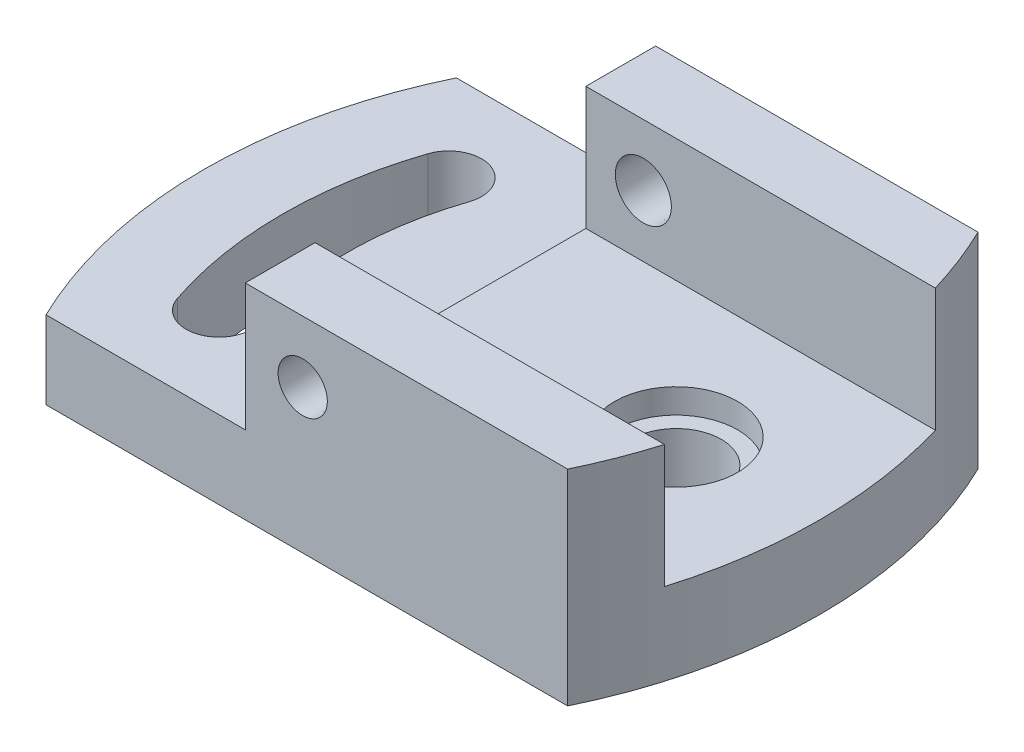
from build123d import *

# Parameters (mm, degrees)
EXTRUDE1_DEPTH     = 19
EXTRUDE2_DEPTH     = 31
CUT_EXTRUDE1_START = -30
CUT_EXTRUDE1_DEPTH = 30
SKETCH5_R          = 7
SKETCH7_R          = 6
CUT_EXTRUDE2_DEPTH = 96.320512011


with BuildPart() as part:
    # Sketch1 → Extrude1 (new body)
    with BuildSketch(Plane(origin=(0, 0, 0), x_dir=(1, 0, 0), z_dir=(0, 1, 0))):
        with BuildLine():
            Line((-63.561575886, 50), (63.561575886, 50))
            ThreePointArc((63.561575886, 50), (75, 0), (63.561575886, -50))
            Line((63.561575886, -50), (-63.561575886, -50))
            ThreePointArc((-63.561575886, -50), (-75, 0), (-63.561575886, 50))
        make_face()
    extrude(amount=EXTRUDE1_DEPTH)

    # Sketch2 → Extrude2 (add)
    with BuildSketch(Plane(origin=(0, 19, 0), x_dir=(-1, 0, 0), z_dir=(0, 1, 0))):
        with BuildLine():
            Line((-63.561575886, -50), (15, -50))
            Line((15, -50), (15, 50))
            Line((15, 50), (-63.561575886, 50))
            ThreePointArc((-63.561575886, 50), (-75, 0), (-63.561575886, -50))
        make_face()
    extrude(amount=EXTRUDE2_DEPTH)

    # Sketch3 → Cut-Extrude1 (cut)
    with BuildSketch(Plane(origin=(0, 50, 0), x_dir=(-1, 0, 0), z_dir=(0, 1, 0)).offset(CUT_EXTRUDE1_START)):
        with BuildLine():
            Line((-70.163514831, 33), (15, 33))
            Line((15, 33), (15, -33))
            Line((15, -33), (-70.163514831, -33))
            ThreePointArc((-70.163514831, -33), (-75, 0), (-70.163514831, 33))
        make_face()
    extrude(amount=CUT_EXTRUDE1_DEPTH, mode=Mode.SUBTRACT)

    # Sketch5 → Cut-Loft1 section 0
    with BuildSketch(Plane(origin=(0, 0, -50), x_dir=(-1, 0, 0), z_dir=(0, 0, -1))):
        with Locations((1, 35)):
            Circle(SKETCH5_R)
    # Sketch7 → Cut-Loft1 section 1
    with BuildSketch(Plane.XY.offset(50)):
        with Locations((-1, 35)):
            Circle(SKETCH7_R)
    loft(mode=Mode.SUBTRACT)

    # Sketch8 → Cut-Extrude2 (cut, through all)
    with BuildSketch(Plane(origin=(0, 19, 0), x_dir=(-1, 0, 0), z_dir=(0, 1, 0))):
        with BuildLine():
            ThreePointArc((35.84237678, -25.454545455), (40.881159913, -35.584237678), (51.010852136, -30.545454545))
            ThreePointArc((51.010852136, -30.545454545), (56, 0), (51.010852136, 30.545454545))
            ThreePointArc((51.010852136, 30.545454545), (40.881159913, 35.584237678), (35.84237678, 25.454545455))
            ThreePointArc((35.84237678, 25.454545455), (40, 0), (35.84237678, -25.454545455))
        make_face()
    extrude(amount=-CUT_EXTRUDE2_DEPTH, mode=Mode.SUBTRACT)

    # Sketch9 → Cut-Revolve1 (revolve, cut)
    with BuildSketch(Plane.XY, mode=Mode.PRIVATE) as cut_revolve1_sk:
        Polygon((40, 20), (55, 20), (55, 14), (51, 14), (51, 0), (40, 0), align=None)
    revolve(cut_revolve1_sk.sketch.rotate(Axis((40, 36.166186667, 0), (0, -1, 0)), 180), axis=Axis((40, 36.166186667, 0), (0, -1, 0)), mode=Mode.SUBTRACT)


solid = part.part
